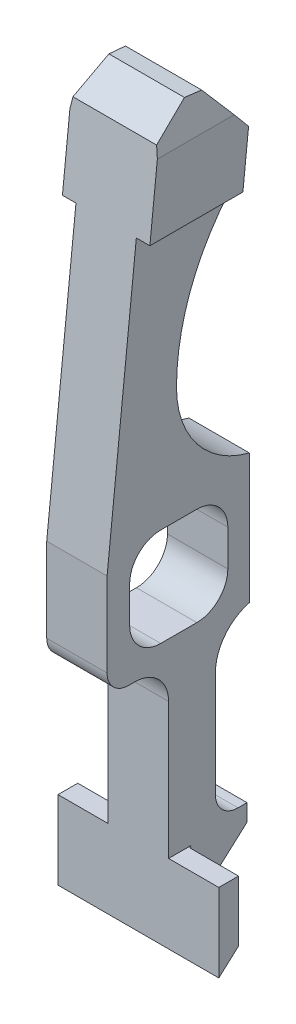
ISO-10303-21;
HEADER;
FILE_DESCRIPTION(('STEP AP214'),'2;1');
FILE_NAME('part.step','',(''),(''),'','','');
FILE_SCHEMA(('AUTOMOTIVE_DESIGN { 1 0 10303 214 1 1 1 1 }'));
ENDSEC;
DATA;
#1=APPLICATION_CONTEXT('core data for automotive mechanical design processes');
#2=APPLICATION_PROTOCOL_DEFINITION('international standard','automotive_design',2000,#1);
#3=PRODUCT_CONTEXT('',#1,'mechanical');
#4=PRODUCT('Part','Part','',(#3));
#5=PRODUCT_RELATED_PRODUCT_CATEGORY('part','',(#4));
#6=PRODUCT_DEFINITION_FORMATION('','',#4);
#7=PRODUCT_DEFINITION_CONTEXT('part definition',#1,'design');
#8=PRODUCT_DEFINITION('design','',#6,#7);
#9=PRODUCT_DEFINITION_SHAPE('','',#8);
#10=(LENGTH_UNIT() NAMED_UNIT(*) SI_UNIT(.MILLI.,.METRE.));
#11=(NAMED_UNIT(*) PLANE_ANGLE_UNIT() SI_UNIT($,.RADIAN.));
#12=(NAMED_UNIT(*) SI_UNIT($,.STERADIAN.) SOLID_ANGLE_UNIT());
#13=UNCERTAINTY_MEASURE_WITH_UNIT(LENGTH_MEASURE(1.E-05),#10,'distance_accuracy_value','');
#14=(GEOMETRIC_REPRESENTATION_CONTEXT(3) GLOBAL_UNCERTAINTY_ASSIGNED_CONTEXT((#13)) GLOBAL_UNIT_ASSIGNED_CONTEXT((#10,
#11,#12)) REPRESENTATION_CONTEXT('',''));
#15=CARTESIAN_POINT('',(0.,0.,0.));
#16=DIRECTION('',(0.,0.,1.));
#17=DIRECTION('',(1.,0.,0.));
#18=AXIS2_PLACEMENT_3D('',#15,#16,#17);
#19=CARTESIAN_POINT('',(1.3589,5.37249489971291,2.8321361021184));
#20=DIRECTION('',(0.,0.104528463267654,0.994521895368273));
#21=DIRECTION('',(0.,-0.994521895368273,0.104528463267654));
#22=AXIS2_PLACEMENT_3D('',#19,#20,#21);
#23=PLANE('',#22);
#24=DIRECTION('',(0.,0.994521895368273,-0.104528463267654));
#25=VECTOR('',#24,1.);
#26=CARTESIAN_POINT('',(1.9685,5.37249489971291,2.8321361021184));
#27=LINE('',#26,#25);
#28=CARTESIAN_POINT('',(1.9685,14.1478,1.90981437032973));
#29=VERTEX_POINT('',#28);
#30=CARTESIAN_POINT('',(1.9685,17.3588295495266,1.57232156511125));
#31=VERTEX_POINT('',#30);
#32=EDGE_CURVE('E337',#29,#31,#27,.T.);
#33=ORIENTED_EDGE('',*,*,#32,.T.);
#34=DIRECTION('',(-0.172725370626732,0.979574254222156,-0.102957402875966));
#35=VECTOR('',#34,1.);
#36=CARTESIAN_POINT('',(4.00077266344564,5.83323854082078,2.78370999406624));
#37=LINE('',#36,#35);
#38=CARTESIAN_POINT('',(1.88398253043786,17.8381519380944,1.52194275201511));
#39=VERTEX_POINT('',#38);
#40=EDGE_CURVE('E296',#31,#39,#37,.T.);
#41=ORIENTED_EDGE('',*,*,#40,.T.);
#42=DIRECTION('',(-1.,0.,0.));
#43=VECTOR('',#42,1.);
#44=CARTESIAN_POINT('',(1.9685,17.8381519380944,1.52194275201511));
#45=LINE('',#44,#43);
#46=CARTESIAN_POINT('',(-1.88398253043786,17.8381519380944,1.52194275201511));
#47=VERTEX_POINT('',#46);
#48=EDGE_CURVE('E318',#39,#47,#45,.T.);
#49=ORIENTED_EDGE('',*,*,#48,.T.);
#50=DIRECTION('',(0.172725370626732,0.979574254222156,-0.102957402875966));
#51=VECTOR('',#50,1.);
#52=CARTESIAN_POINT('',(-3.91968967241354,6.29308303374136,2.73537839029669));
#53=LINE('',#52,#51);
#54=CARTESIAN_POINT('',(-1.9685,17.3588295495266,1.57232156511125));
#55=VERTEX_POINT('',#54);
#56=EDGE_CURVE('E378',#55,#47,#53,.T.);
#57=ORIENTED_EDGE('',*,*,#56,.F.);
#58=DIRECTION('',(0.,0.994521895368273,-0.104528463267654));
#59=VECTOR('',#58,1.);
#60=CARTESIAN_POINT('',(-1.9685,5.37249489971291,2.8321361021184));
#61=LINE('',#60,#59);
#62=CARTESIAN_POINT('',(-1.9685,14.1478,1.90981437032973));
#63=VERTEX_POINT('',#62);
#64=EDGE_CURVE('E326',#63,#55,#61,.T.);
#65=ORIENTED_EDGE('',*,*,#64,.F.);
#66=DIRECTION('',(-1.,0.,0.));
#67=VECTOR('',#66,1.);
#68=CARTESIAN_POINT('',(1.9685,14.1478,1.90981437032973));
#69=LINE('',#68,#67);
#70=CARTESIAN_POINT('',(-1.3589,14.1478,1.90981437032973));
#71=VERTEX_POINT('',#70);
#72=EDGE_CURVE('E353',#71,#63,#69,.T.);
#73=ORIENTED_EDGE('',*,*,#72,.F.);
#74=DIRECTION('',(0.,0.994521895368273,-0.104528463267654));
#75=VECTOR('',#74,1.);
#76=CARTESIAN_POINT('',(-1.3589,5.37249489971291,2.8321361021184));
#77=LINE('',#76,#75);
#78=CARTESIAN_POINT('',(-1.3589,1.62703310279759,3.22579999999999));
#79=VERTEX_POINT('',#78);
#80=EDGE_CURVE('E536',#79,#71,#77,.T.);
#81=ORIENTED_EDGE('',*,*,#80,.F.);
#82=DIRECTION('',(-1.,0.,0.));
#83=VECTOR('',#82,1.);
#84=CARTESIAN_POINT('',(1.3589,1.62703310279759,3.22579999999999));
#85=LINE('',#84,#83);
#86=CARTESIAN_POINT('',(1.3589,1.62703310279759,3.22579999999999));
#87=VERTEX_POINT('',#86);
#88=EDGE_CURVE('E677',#87,#79,#85,.T.);
#89=ORIENTED_EDGE('',*,*,#88,.F.);
#90=DIRECTION('',(0.,0.994521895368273,-0.104528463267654));
#91=VECTOR('',#90,1.);
#92=CARTESIAN_POINT('',(1.3589,5.37249489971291,2.8321361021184));
#93=LINE('',#92,#91);
#94=CARTESIAN_POINT('',(1.3589,14.1478,1.90981437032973));
#95=VERTEX_POINT('',#94);
#96=EDGE_CURVE('E477',#87,#95,#93,.T.);
#97=ORIENTED_EDGE('',*,*,#96,.T.);
#98=EDGE_CURVE('E357',#29,#95,#69,.T.);
#99=ORIENTED_EDGE('',*,*,#98,.F.);
#100=EDGE_LOOP('',(#33,#41,#49,#57,#65,#73,#81,#89,#97,#99));
#101=FACE_BOUND('',#100,.T.);
#102=ADVANCED_FACE('F30',(#101),#23,.T.);
#103=CARTESIAN_POINT('',(1.9685,-4.45635367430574,-20.1908234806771));
#104=DIRECTION('',(0.,0.642787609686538,-0.766044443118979));
#105=DIRECTION('',(0.,0.766044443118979,0.642787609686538));
#106=AXIS2_PLACEMENT_3D('',#103,#104,#105);
#107=PLANE('',#106);
#108=DIRECTION('',(-1.,0.,0.));
#109=VECTOR('',#108,1.);
#110=CARTESIAN_POINT('',(1.9685,18.8031788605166,-0.673758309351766));
#111=LINE('',#110,#109);
#112=CARTESIAN_POINT('',(1.71382224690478,18.8031788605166,-0.673758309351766));
#113=VERTEX_POINT('',#112);
#114=CARTESIAN_POINT('',(-1.71382224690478,18.8031788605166,-0.673758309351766));
#115=VERTEX_POINT('',#114);
#116=EDGE_CURVE('E311',#113,#115,#111,.T.);
#117=ORIENTED_EDGE('',*,*,#116,.F.);
#118=DIRECTION('',(0.133858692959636,-0.759150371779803,-0.637002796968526));
#119=VECTOR('',#118,1.);
#120=CARTESIAN_POINT('',(5.74618134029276,-4.06546595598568,-19.862829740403));
#121=LINE('',#120,#119);
#122=CARTESIAN_POINT('',(1.9685,17.3588295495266,-1.88571128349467));
#123=VERTEX_POINT('',#122);
#124=EDGE_CURVE('E293',#113,#123,#121,.T.);
#125=ORIENTED_EDGE('',*,*,#124,.T.);
#126=DIRECTION('',(0.,-0.766044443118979,-0.642787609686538));
#127=VECTOR('',#126,1.);
#128=CARTESIAN_POINT('',(1.9685,-4.45635367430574,-20.1908234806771));
#129=LINE('',#128,#127);
#130=CARTESIAN_POINT('',(1.9685,16.5851487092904,-2.53490659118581));
#131=VERTEX_POINT('',#130);
#132=EDGE_CURVE('E308',#123,#131,#129,.T.);
#133=ORIENTED_EDGE('',*,*,#132,.T.);
#134=DIRECTION('',(-1.,0.,0.));
#135=VECTOR('',#134,1.);
#136=CARTESIAN_POINT('',(1.9685,16.5851487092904,-2.53490659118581));
#137=LINE('',#136,#135);
#138=CARTESIAN_POINT('',(-1.9685,16.5851487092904,-2.53490659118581));
#139=VERTEX_POINT('',#138);
#140=EDGE_CURVE('E341',#131,#139,#137,.T.);
#141=ORIENTED_EDGE('',*,*,#140,.T.);
#142=DIRECTION('',(0.,-0.766044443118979,-0.642787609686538));
#143=VECTOR('',#142,1.);
#144=CARTESIAN_POINT('',(-1.9685,-4.45635367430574,-20.1908234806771));
#145=LINE('',#144,#143);
#146=CARTESIAN_POINT('',(-1.9685,17.3588295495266,-1.88571128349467));
#147=VERTEX_POINT('',#146);
#148=EDGE_CURVE('E336',#147,#139,#145,.T.);
#149=ORIENTED_EDGE('',*,*,#148,.F.);
#150=DIRECTION('',(-0.133858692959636,-0.759150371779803,-0.637002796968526));
#151=VECTOR('',#150,1.);
#152=CARTESIAN_POINT('',(-5.67563758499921,-3.66539243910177,-19.5271281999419));
#153=LINE('',#152,#151);
#154=EDGE_CURVE('E375',#115,#147,#153,.T.);
#155=ORIENTED_EDGE('',*,*,#154,.F.);
#156=EDGE_LOOP('',(#117,#125,#133,#141,#149,#155));
#157=FACE_BOUND('',#156,.T.);
#158=ADVANCED_FACE('F306',(#157),#107,.T.);
#159=CARTESIAN_POINT('',(1.9685,15.7763416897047,-29.4721902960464));
#160=DIRECTION('',(0.,-0.994521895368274,0.104528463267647));
#161=DIRECTION('',(0.,-0.104528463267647,-0.994521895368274));
#162=AXIS2_PLACEMENT_3D('',#159,#160,#161);
#163=PLANE('',#162);
#164=DIRECTION('',(-0.0184280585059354,0.104510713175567,0.99435301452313));
#165=VECTOR('',#164,1.);
#166=CARTESIAN_POINT('',(2.24744054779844,15.776879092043,-29.4670772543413));
#167=LINE('',#166,#165);
#168=CARTESIAN_POINT('',(1.69977768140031,18.8828295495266,0.0840673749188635));
#169=VERTEX_POINT('',#168);
#170=EDGE_CURVE('E312',#113,#169,#167,.T.);
#171=ORIENTED_EDGE('',*,*,#170,.F.);
#172=ORIENTED_EDGE('',*,*,#116,.T.);
#173=DIRECTION('',(0.0184280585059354,0.104510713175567,0.99435301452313));
#174=VECTOR('',#173,1.);
#175=CARTESIAN_POINT('',(-2.24610356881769,15.7844614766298,-29.3949356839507));
#176=LINE('',#175,#174);
#177=CARTESIAN_POINT('',(-1.69977768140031,18.8828295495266,0.0840673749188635));
#178=VERTEX_POINT('',#177);
#179=EDGE_CURVE('E379',#115,#178,#176,.T.);
#180=ORIENTED_EDGE('',*,*,#179,.T.);
#181=DIRECTION('',(-1.,0.,0.));
#182=VECTOR('',#181,1.);
#183=CARTESIAN_POINT('',(1.9685,18.8828295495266,0.0840673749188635));
#184=LINE('',#183,#182);
#185=EDGE_CURVE('E320',#169,#178,#184,.T.);
#186=ORIENTED_EDGE('',*,*,#185,.F.);
#187=EDGE_LOOP('',(#171,#172,#180,#186));
#188=FACE_BOUND('',#187,.T.);
#189=ADVANCED_FACE('F739',(#188),#163,.F.);
#190=CARTESIAN_POINT('',(1.9685,26.4668480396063,-10.3544385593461));
#191=DIRECTION('',(0.,-0.809016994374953,-0.587785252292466));
#192=DIRECTION('',(0.,0.587785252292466,-0.809016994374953));
#193=AXIS2_PLACEMENT_3D('',#190,#191,#192);
#194=PLANE('',#193);
#195=DIRECTION('',(0.103090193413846,-0.58465353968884,0.80470656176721));
#196=VECTOR('',#195,1.);
#197=CARTESIAN_POINT('',(0.379578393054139,26.3700517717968,-10.221209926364));
#198=LINE('',#197,#196);
#199=EDGE_CURVE('E701',#169,#39,#198,.T.);
#200=ORIENTED_EDGE('',*,*,#199,.F.);
#201=ORIENTED_EDGE('',*,*,#185,.T.);
#202=DIRECTION('',(-0.103090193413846,-0.58465353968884,0.80470656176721));
#203=VECTOR('',#202,1.);
#204=CARTESIAN_POINT('',(-0.337737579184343,26.6073428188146,-10.547813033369));
#205=LINE('',#204,#203);
#206=EDGE_CURVE('E385',#178,#47,#205,.T.);
#207=ORIENTED_EDGE('',*,*,#206,.T.);
#208=ORIENTED_EDGE('',*,*,#48,.F.);
#209=EDGE_LOOP('',(#200,#201,#207,#208));
#210=FACE_BOUND('',#209,.T.);
#211=ADVANCED_FACE('F696',(#210),#194,.F.);
#212=CARTESIAN_POINT('',(1.9685,2.12794584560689,-28.0376860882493));
#213=DIRECTION('',(1.,0.,0.));
#214=DIRECTION('',(0.,0.,-1.));
#215=AXIS2_PLACEMENT_3D('',#212,#213,#214);
#216=PLANE('',#215);
#217=ORIENTED_EDGE('',*,*,#132,.F.);
#218=DIRECTION('',(0.,0.,1.));
#219=VECTOR('',#218,1.);
#220=CARTESIAN_POINT('',(1.9685,17.3588295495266,-28.0376860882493));
#221=LINE('',#220,#219);
#222=EDGE_CURVE('E290',#123,#31,#221,.T.);
#223=ORIENTED_EDGE('',*,*,#222,.T.);
#224=ORIENTED_EDGE('',*,*,#32,.F.);
#225=DIRECTION('',(0.,0.,-1.));
#226=VECTOR('',#225,1.);
#227=CARTESIAN_POINT('',(1.9685,14.1478,-28.0376860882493));
#228=LINE('',#227,#226);
#229=CARTESIAN_POINT('',(1.9685,14.1478,-2.27873091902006));
#230=VERTEX_POINT('',#229);
#231=EDGE_CURVE('E322',#29,#230,#228,.T.);
#232=ORIENTED_EDGE('',*,*,#231,.T.);
#233=DIRECTION('',(0.,-0.994521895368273,0.104528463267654));
#234=VECTOR('',#233,1.);
#235=CARTESIAN_POINT('',(1.9685,4.93707113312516,-1.31064430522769));
#236=LINE('',#235,#234);
#237=EDGE_CURVE('E317',#131,#230,#236,.T.);
#238=ORIENTED_EDGE('',*,*,#237,.F.);
#239=EDGE_LOOP('',(#217,#223,#224,#232,#238));
#240=FACE_BOUND('',#239,.T.);
#241=ADVANCED_FACE('F315',(#240),#216,.T.);
#242=CARTESIAN_POINT('',(1.3589,2.12794584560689,-28.0376860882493));
#243=DIRECTION('',(1.,0.,0.));
#244=DIRECTION('',(0.,0.,-1.));
#245=AXIS2_PLACEMENT_3D('',#242,#243,#244);
#246=PLANE('',#245);
#247=CARTESIAN_POINT('',(1.3589,0.812800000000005,0.812799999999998));
#248=DIRECTION('',(1.,0.,0.));
#249=DIRECTION('',(0.,0.,-1.));
#250=AXIS2_PLACEMENT_3D('',#247,#248,#249);
#251=CIRCLE('',#250,1.397);
#252=CARTESIAN_POINT('',(1.3589,2.2098,0.812799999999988));
#253=VERTEX_POINT('',#252);
#254=CARTESIAN_POINT('',(1.3589,0.812799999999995,2.2098));
#255=VERTEX_POINT('',#254);
#256=EDGE_CURVE('E429',#253,#255,#251,.T.);
#257=ORIENTED_EDGE('',*,*,#256,.F.);
#258=DIRECTION('',(0.,0.,1.));
#259=VECTOR('',#258,1.);
#260=CARTESIAN_POINT('',(1.3589,2.2098,0.812799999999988));
#261=LINE('',#260,#259);
#262=CARTESIAN_POINT('',(1.3589,2.2098,-0.812799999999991));
#263=VERTEX_POINT('',#262);
#264=EDGE_CURVE('E449',#263,#253,#261,.T.);
#265=ORIENTED_EDGE('',*,*,#264,.F.);
#266=CARTESIAN_POINT('',(1.3589,0.812800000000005,-0.812800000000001));
#267=DIRECTION('',(1.,0.,0.));
#268=DIRECTION('',(0.,0.,-1.));
#269=AXIS2_PLACEMENT_3D('',#266,#267,#268);
#270=CIRCLE('',#269,1.397);
#271=CARTESIAN_POINT('',(1.3589,0.812799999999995,-2.2098));
#272=VERTEX_POINT('',#271);
#273=EDGE_CURVE('E446',#272,#263,#270,.T.);
#274=ORIENTED_EDGE('',*,*,#273,.F.);
#275=DIRECTION('',(0.,1.,0.));
#276=VECTOR('',#275,1.);
#277=CARTESIAN_POINT('',(1.3589,-0.812799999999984,-2.2098));
#278=LINE('',#277,#276);
#279=CARTESIAN_POINT('',(1.3589,-0.812799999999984,-2.2098));
#280=VERTEX_POINT('',#279);
#281=EDGE_CURVE('E443',#280,#272,#278,.T.);
#282=ORIENTED_EDGE('',*,*,#281,.F.);
#283=CARTESIAN_POINT('',(1.3589,-0.812799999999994,-0.812800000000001));
#284=DIRECTION('',(1.,0.,0.));
#285=DIRECTION('',(0.,0.,-1.));
#286=AXIS2_PLACEMENT_3D('',#283,#284,#285);
#287=CIRCLE('',#286,1.397);
#288=CARTESIAN_POINT('',(1.3589,-2.20979999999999,-0.812799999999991));
#289=VERTEX_POINT('',#288);
#290=EDGE_CURVE('E440',#289,#280,#287,.T.);
#291=ORIENTED_EDGE('',*,*,#290,.F.);
#292=DIRECTION('',(0.,0.,-1.));
#293=VECTOR('',#292,1.);
#294=CARTESIAN_POINT('',(1.3589,-2.20979999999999,0.812799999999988));
#295=LINE('',#294,#293);
#296=CARTESIAN_POINT('',(1.3589,-2.20979999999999,0.812799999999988));
#297=VERTEX_POINT('',#296);
#298=EDGE_CURVE('E437',#297,#289,#295,.T.);
#299=ORIENTED_EDGE('',*,*,#298,.F.);
#300=CARTESIAN_POINT('',(1.3589,-0.812799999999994,0.812799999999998));
#301=DIRECTION('',(1.,0.,0.));
#302=DIRECTION('',(0.,0.,-1.));
#303=AXIS2_PLACEMENT_3D('',#300,#301,#302);
#304=CIRCLE('',#303,1.397);
#305=CARTESIAN_POINT('',(1.3589,-0.812799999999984,2.2098));
#306=VERTEX_POINT('',#305);
#307=EDGE_CURVE('E434',#306,#297,#304,.T.);
#308=ORIENTED_EDGE('',*,*,#307,.F.);
#309=DIRECTION('',(0.,-1.,0.));
#310=VECTOR('',#309,1.);
#311=CARTESIAN_POINT('',(1.3589,-0.812799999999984,2.2098));
#312=LINE('',#311,#310);
#313=EDGE_CURVE('E431',#255,#306,#312,.T.);
#314=ORIENTED_EDGE('',*,*,#313,.F.);
#315=EDGE_LOOP('',(#257,#265,#274,#282,#291,#299,#308,#314));
#316=FACE_BOUND('',#315,.T.);
#317=DIRECTION('',(0.,0.,1.));
#318=VECTOR('',#317,1.);
#319=CARTESIAN_POINT('',(1.3589,-10.7696,0.457199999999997));
#320=LINE('',#319,#318);
#321=CARTESIAN_POINT('',(1.3589,-10.7696,-0.558800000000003));
#322=VERTEX_POINT('',#321);
#323=CARTESIAN_POINT('',(1.3589,-10.7696,0.457199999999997));
#324=VERTEX_POINT('',#323);
#325=EDGE_CURVE('E409',#322,#324,#320,.T.);
#326=ORIENTED_EDGE('',*,*,#325,.F.);
#327=DIRECTION('',(0.,1.,0.));
#328=VECTOR('',#327,1.);
#329=CARTESIAN_POINT('',(1.3589,2.12794584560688,-0.558800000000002));
#330=LINE('',#329,#328);
#331=CARTESIAN_POINT('',(1.3589,-13.3853894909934,-0.558800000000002));
#332=VERTEX_POINT('',#331);
#333=EDGE_CURVE('E571',#322,#332,#330,.F.);
#334=ORIENTED_EDGE('',*,*,#333,.T.);
#335=DIRECTION('',(0.,0.669130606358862,-0.743144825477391));
#336=VECTOR('',#335,1.);
#337=CARTESIAN_POINT('',(1.3589,7.22466256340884,-23.4485817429));
#338=LINE('',#337,#336);
#339=CARTESIAN_POINT('',(1.3589,-11.121233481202,-3.0734));
#340=VERTEX_POINT('',#339);
#341=EDGE_CURVE('E503',#332,#340,#338,.T.);
#342=ORIENTED_EDGE('',*,*,#341,.T.);
#343=DIRECTION('',(0.,1.,0.));
#344=VECTOR('',#343,1.);
#345=CARTESIAN_POINT('',(1.3589,2.12794584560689,-3.0734));
#346=LINE('',#345,#344);
#347=CARTESIAN_POINT('',(1.3589,-10.359233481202,-3.0734));
#348=VERTEX_POINT('',#347);
#349=EDGE_CURVE('E505',#340,#348,#346,.T.);
#350=ORIENTED_EDGE('',*,*,#349,.T.);
#351=DIRECTION('',(0.,0.,1.));
#352=VECTOR('',#351,1.);
#353=CARTESIAN_POINT('',(1.3589,-10.359233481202,-28.0376860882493));
#354=LINE('',#353,#352);
#355=CARTESIAN_POINT('',(1.3589,-10.359233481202,-2.667));
#356=VERTEX_POINT('',#355);
#357=EDGE_CURVE('E507',#348,#356,#354,.T.);
#358=ORIENTED_EDGE('',*,*,#357,.T.);
#359=CARTESIAN_POINT('',(1.3589,-9.34323348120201,-2.667));
#360=DIRECTION('',(1.,0.,0.));
#361=DIRECTION('',(0.,0.,-1.));
#362=AXIS2_PLACEMENT_3D('',#359,#360,#361);
#363=CIRCLE('',#362,1.016);
#364=CARTESIAN_POINT('',(1.3589,-9.34323348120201,-1.651));
#365=VERTEX_POINT('',#364);
#366=EDGE_CURVE('E509',#365,#356,#363,.T.);
#367=ORIENTED_EDGE('',*,*,#366,.F.);
#368=DIRECTION('',(0.,-1.,0.));
#369=VECTOR('',#368,1.);
#370=CARTESIAN_POINT('',(1.3589,2.12794584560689,-1.651));
#371=LINE('',#370,#369);
#372=CARTESIAN_POINT('',(1.3589,-4.58367553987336,-1.651));
#373=VERTEX_POINT('',#372);
#374=EDGE_CURVE('E512',#373,#365,#371,.T.);
#375=ORIENTED_EDGE('',*,*,#374,.F.);
#376=CARTESIAN_POINT('',(1.3589,-4.58367553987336,-3.683));
#377=DIRECTION('',(1.,0.,0.));
#378=DIRECTION('',(0.,0.,-1.));
#379=AXIS2_PLACEMENT_3D('',#376,#377,#378);
#380=CIRCLE('',#379,2.032);
#381=CARTESIAN_POINT('',(1.3589,-2.6162,-3.175));
#382=VERTEX_POINT('',#381);
#383=EDGE_CURVE('E515',#382,#373,#380,.T.);
#384=ORIENTED_EDGE('',*,*,#383,.F.);
#385=DIRECTION('',(0.,-1.,0.));
#386=VECTOR('',#385,1.);
#387=CARTESIAN_POINT('',(1.3589,2.12794584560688,-3.175));
#388=LINE('',#387,#386);
#389=CARTESIAN_POINT('',(1.3589,3.22626184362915,-3.175));
#390=VERTEX_POINT('',#389);
#391=EDGE_CURVE('E518',#390,#382,#388,.T.);
#392=ORIENTED_EDGE('',*,*,#391,.F.);
#393=CARTESIAN_POINT('',(1.3589,7.4168,-4.2164));
#394=DIRECTION('',(1.,0.,0.));
#395=DIRECTION('',(0.,0.,-1.));
#396=AXIS2_PLACEMENT_3D('',#393,#394,#395);
#397=CIRCLE('',#396,4.318);
#398=CARTESIAN_POINT('',(1.3589,7.41680000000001,0.1016));
#399=VERTEX_POINT('',#398);
#400=EDGE_CURVE('E521',#399,#390,#397,.T.);
#401=ORIENTED_EDGE('',*,*,#400,.F.);
#402=CARTESIAN_POINT('',(1.3589,7.4168,-9.8044));
#403=DIRECTION('',(1.,0.,0.));
#404=DIRECTION('',(0.,0.,-1.));
#405=AXIS2_PLACEMENT_3D('',#402,#403,#404);
#406=CIRCLE('',#405,9.906);
#407=CARTESIAN_POINT('',(1.3589,13.8175404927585,-2.24401924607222));
#408=VERTEX_POINT('',#407);
#409=EDGE_CURVE('E482',#408,#399,#406,.T.);
#410=ORIENTED_EDGE('',*,*,#409,.F.);
#411=DIRECTION('',(0.,-0.994521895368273,0.104528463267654));
#412=VECTOR('',#411,1.);
#413=CARTESIAN_POINT('',(1.3589,4.93707113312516,-1.31064430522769));
#414=LINE('',#413,#412);
#415=CARTESIAN_POINT('',(1.3589,14.1478,-2.27873091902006));
#416=VERTEX_POINT('',#415);
#417=EDGE_CURVE('E478',#416,#408,#414,.T.);
#418=ORIENTED_EDGE('',*,*,#417,.F.);
#419=DIRECTION('',(0.,0.,-1.));
#420=VECTOR('',#419,1.);
#421=CARTESIAN_POINT('',(1.3589,14.1478,-28.0376860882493));
#422=LINE('',#421,#420);
#423=EDGE_CURVE('E473',#95,#416,#422,.T.);
#424=ORIENTED_EDGE('',*,*,#423,.F.);
#425=ORIENTED_EDGE('',*,*,#96,.F.);
#426=DIRECTION('',(0.,-1.,0.));
#427=VECTOR('',#426,1.);
#428=CARTESIAN_POINT('',(1.3589,2.12794584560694,3.22579999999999));
#429=LINE('',#428,#427);
#430=CARTESIAN_POINT('',(1.3589,-2.15839002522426,3.2258));
#431=VERTEX_POINT('',#430);
#432=EDGE_CURVE('E480',#87,#431,#429,.T.);
#433=ORIENTED_EDGE('',*,*,#432,.T.);
#434=CARTESIAN_POINT('',(1.3589,-2.15839002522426,2.25999002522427));
#435=DIRECTION('',(1.,0.,0.));
#436=DIRECTION('',(0.,0.,-1.));
#437=AXIS2_PLACEMENT_3D('',#434,#435,#436);
#438=CIRCLE('',#437,0.965809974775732);
#439=CARTESIAN_POINT('',(1.3589,-3.12419999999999,2.25999002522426));
#440=VERTEX_POINT('',#439);
#441=EDGE_CURVE('E493',#431,#440,#438,.T.);
#442=ORIENTED_EDGE('',*,*,#441,.T.);
#443=DIRECTION('',(0.,0.,-1.));
#444=VECTOR('',#443,1.);
#445=CARTESIAN_POINT('',(1.3589,-3.12419999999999,-28.0376860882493));
#446=LINE('',#445,#444);
#447=CARTESIAN_POINT('',(1.3589,-3.12419999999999,1.9812));
#448=VERTEX_POINT('',#447);
#449=EDGE_CURVE('E495',#440,#448,#446,.T.);
#450=ORIENTED_EDGE('',*,*,#449,.T.);
#451=CARTESIAN_POINT('',(1.3589,-4.64819999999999,1.9812));
#452=DIRECTION('',(1.,0.,0.));
#453=DIRECTION('',(0.,0.,-1.));
#454=AXIS2_PLACEMENT_3D('',#451,#452,#453);
#455=CIRCLE('',#454,1.524);
#456=CARTESIAN_POINT('',(1.3589,-4.64819999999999,0.457199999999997));
#457=VERTEX_POINT('',#456);
#458=EDGE_CURVE('E497',#457,#448,#455,.T.);
#459=ORIENTED_EDGE('',*,*,#458,.F.);
#460=DIRECTION('',(0.,-1.,0.));
#461=VECTOR('',#460,1.);
#462=CARTESIAN_POINT('',(1.3589,2.12794584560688,0.457199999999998));
#463=LINE('',#462,#461);
#464=EDGE_CURVE('E500',#457,#324,#463,.T.);
#465=ORIENTED_EDGE('',*,*,#464,.T.);
#466=EDGE_LOOP('',(#326,#334,#342,#350,#358,#367,#375,#384,#392,#401,#410,#418,#424,#425,#433,
#442,#450,#459,#465));
#467=FACE_BOUND('',#466,.T.);
#468=ADVANCED_FACE('F702',(#316,#467),#246,.T.);
#469=CARTESIAN_POINT('',(1.3589,7.4168,-9.8044));
#470=DIRECTION('',(-1.,0.,0.));
#471=DIRECTION('',(0.,0.,1.));
#472=AXIS2_PLACEMENT_3D('',#469,#470,#471);
#473=CYLINDRICAL_SURFACE('',#472,9.906);
#474=CARTESIAN_POINT('',(-1.3589,7.4168,-9.8044));
#475=DIRECTION('',(1.,0.,0.));
#476=DIRECTION('',(0.,0.,-1.));
#477=AXIS2_PLACEMENT_3D('',#474,#475,#476);
#478=CIRCLE('',#477,9.906);
#479=CARTESIAN_POINT('',(-1.3589,13.8175404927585,-2.24401924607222));
#480=VERTEX_POINT('',#479);
#481=CARTESIAN_POINT('',(-1.3589,7.41680000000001,0.1016));
#482=VERTEX_POINT('',#481);
#483=EDGE_CURVE('E525',#480,#482,#478,.T.);
#484=ORIENTED_EDGE('',*,*,#483,.F.);
#485=DIRECTION('',(-1.,0.,0.));
#486=VECTOR('',#485,1.);
#487=CARTESIAN_POINT('',(1.3589,13.8175404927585,-2.24401924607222));
#488=LINE('',#487,#486);
#489=EDGE_CURVE('E486',#408,#480,#488,.T.);
#490=ORIENTED_EDGE('',*,*,#489,.F.);
#491=ORIENTED_EDGE('',*,*,#409,.T.);
#492=DIRECTION('',(-1.,0.,0.));
#493=VECTOR('',#492,1.);
#494=CARTESIAN_POINT('',(1.3589,7.41680000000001,0.1016));
#495=LINE('',#494,#493);
#496=EDGE_CURVE('E524',#399,#482,#495,.T.);
#497=ORIENTED_EDGE('',*,*,#496,.T.);
#498=EDGE_LOOP('',(#484,#490,#491,#497));
#499=FACE_BOUND('',#498,.T.);
#500=ADVANCED_FACE('F685',(#499),#473,.F.);
#501=CARTESIAN_POINT('',(1.3589,4.93707113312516,-1.31064430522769));
#502=DIRECTION('',(0.,-0.104528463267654,-0.994521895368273));
#503=DIRECTION('',(0.,0.994521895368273,-0.104528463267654));
#504=AXIS2_PLACEMENT_3D('',#501,#502,#503);
#505=PLANE('',#504);
#506=DIRECTION('',(0.,-0.994521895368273,0.104528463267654));
#507=VECTOR('',#506,1.);
#508=CARTESIAN_POINT('',(-1.3589,4.93707113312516,-1.31064430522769));
#509=LINE('',#508,#507);
#510=CARTESIAN_POINT('',(-1.3589,14.1478,-2.27873091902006));
#511=VERTEX_POINT('',#510);
#512=EDGE_CURVE('E363',#511,#480,#509,.T.);
#513=ORIENTED_EDGE('',*,*,#512,.F.);
#514=DIRECTION('',(-1.,0.,0.));
#515=VECTOR('',#514,1.);
#516=CARTESIAN_POINT('',(1.9685,14.1478,-2.27873091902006));
#517=LINE('',#516,#515);
#518=CARTESIAN_POINT('',(-1.9685,14.1478,-2.27873091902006));
#519=VERTEX_POINT('',#518);
#520=EDGE_CURVE('E343',#511,#519,#517,.T.);
#521=ORIENTED_EDGE('',*,*,#520,.T.);
#522=DIRECTION('',(0.,-0.994521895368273,0.104528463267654));
#523=VECTOR('',#522,1.);
#524=CARTESIAN_POINT('',(-1.9685,4.93707113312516,-1.31064430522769));
#525=LINE('',#524,#523);
#526=EDGE_CURVE('E333',#139,#519,#525,.T.);
#527=ORIENTED_EDGE('',*,*,#526,.F.);
#528=ORIENTED_EDGE('',*,*,#140,.F.);
#529=ORIENTED_EDGE('',*,*,#237,.T.);
#530=EDGE_CURVE('E351',#230,#416,#517,.T.);
#531=ORIENTED_EDGE('',*,*,#530,.T.);
#532=ORIENTED_EDGE('',*,*,#417,.T.);
#533=ORIENTED_EDGE('',*,*,#489,.T.);
#534=EDGE_LOOP('',(#513,#521,#527,#528,#529,#531,#532,#533));
#535=FACE_BOUND('',#534,.T.);
#536=ADVANCED_FACE('F361',(#535),#505,.T.);
#537=CARTESIAN_POINT('',(1.3589,2.12794584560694,3.22579999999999));
#538=DIRECTION('',(0.,0.,-1.));
#539=DIRECTION('',(0.,1.,0.));
#540=AXIS2_PLACEMENT_3D('',#537,#538,#539);
#541=PLANE('',#540);
#542=DIRECTION('',(0.,-1.,0.));
#543=VECTOR('',#542,1.);
#544=CARTESIAN_POINT('',(-1.3589,2.12794584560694,3.22579999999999));
#545=LINE('',#544,#543);
#546=CARTESIAN_POINT('',(-1.3589,-2.15839002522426,3.2258));
#547=VERTEX_POINT('',#546);
#548=EDGE_CURVE('E530',#79,#547,#545,.T.);
#549=ORIENTED_EDGE('',*,*,#548,.T.);
#550=DIRECTION('',(-1.,0.,0.));
#551=VECTOR('',#550,1.);
#552=CARTESIAN_POINT('',(1.3589,-2.15839002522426,3.2258));
#553=LINE('',#552,#551);
#554=EDGE_CURVE('E675',#431,#547,#553,.T.);
#555=ORIENTED_EDGE('',*,*,#554,.F.);
#556=ORIENTED_EDGE('',*,*,#432,.F.);
#557=ORIENTED_EDGE('',*,*,#88,.T.);
#558=EDGE_LOOP('',(#549,#555,#556,#557));
#559=FACE_BOUND('',#558,.T.);
#560=ADVANCED_FACE('F706',(#559),#541,.F.);
#561=CARTESIAN_POINT('',(1.3589,-2.15839002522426,2.25999002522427));
#562=DIRECTION('',(-1.,0.,0.));
#563=DIRECTION('',(0.,0.,1.));
#564=AXIS2_PLACEMENT_3D('',#561,#562,#563);
#565=CYLINDRICAL_SURFACE('',#564,0.965809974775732);
#566=CARTESIAN_POINT('',(-1.3589,-2.15839002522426,2.25999002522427));
#567=DIRECTION('',(1.,0.,0.));
#568=DIRECTION('',(0.,0.,-1.));
#569=AXIS2_PLACEMENT_3D('',#566,#567,#568);
#570=CIRCLE('',#569,0.965809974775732);
#571=CARTESIAN_POINT('',(-1.3589,-3.12419999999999,2.25999002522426));
#572=VERTEX_POINT('',#571);
#573=EDGE_CURVE('E711',#547,#572,#570,.T.);
#574=ORIENTED_EDGE('',*,*,#573,.T.);
#575=DIRECTION('',(-1.,0.,0.));
#576=VECTOR('',#575,1.);
#577=CARTESIAN_POINT('',(1.3589,-3.12419999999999,2.25999002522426));
#578=LINE('',#577,#576);
#579=EDGE_CURVE('E672',#440,#572,#578,.T.);
#580=ORIENTED_EDGE('',*,*,#579,.F.);
#581=ORIENTED_EDGE('',*,*,#441,.F.);
#582=ORIENTED_EDGE('',*,*,#554,.T.);
#583=EDGE_LOOP('',(#574,#580,#581,#582));
#584=FACE_BOUND('',#583,.T.);
#585=ADVANCED_FACE('F709',(#584),#565,.T.);
#586=CARTESIAN_POINT('',(1.3589,-3.12419999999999,-28.0376860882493));
#587=DIRECTION('',(0.,1.,0.));
#588=DIRECTION('',(0.,0.,1.));
#589=AXIS2_PLACEMENT_3D('',#586,#587,#588);
#590=PLANE('',#589);
#591=DIRECTION('',(0.,0.,-1.));
#592=VECTOR('',#591,1.);
#593=CARTESIAN_POINT('',(-1.3589,-3.12419999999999,-28.0376860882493));
#594=LINE('',#593,#592);
#595=CARTESIAN_POINT('',(-1.3589,-3.12419999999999,1.9812));
#596=VERTEX_POINT('',#595);
#597=EDGE_CURVE('E723',#572,#596,#594,.T.);
#598=ORIENTED_EDGE('',*,*,#597,.T.);
#599=DIRECTION('',(-1.,0.,0.));
#600=VECTOR('',#599,1.);
#601=CARTESIAN_POINT('',(1.3589,-3.12419999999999,1.9812));
#602=LINE('',#601,#600);
#603=EDGE_CURVE('E670',#448,#596,#602,.T.);
#604=ORIENTED_EDGE('',*,*,#603,.F.);
#605=ORIENTED_EDGE('',*,*,#449,.F.);
#606=ORIENTED_EDGE('',*,*,#579,.T.);
#607=EDGE_LOOP('',(#598,#604,#605,#606));
#608=FACE_BOUND('',#607,.T.);
#609=ADVANCED_FACE('F716',(#608),#590,.F.);
#610=CARTESIAN_POINT('',(1.3589,-4.64819999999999,1.9812));
#611=DIRECTION('',(-1.,0.,0.));
#612=DIRECTION('',(0.,0.,1.));
#613=AXIS2_PLACEMENT_3D('',#610,#611,#612);
#614=CYLINDRICAL_SURFACE('',#613,1.524);
#615=CARTESIAN_POINT('',(-1.3589,-4.64819999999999,1.9812));
#616=DIRECTION('',(1.,0.,0.));
#617=DIRECTION('',(0.,0.,-1.));
#618=AXIS2_PLACEMENT_3D('',#615,#616,#617);
#619=CIRCLE('',#618,1.524);
#620=CARTESIAN_POINT('',(-1.3589,-4.64819999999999,0.457199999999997));
#621=VERTEX_POINT('',#620);
#622=EDGE_CURVE('E633',#621,#596,#619,.T.);
#623=ORIENTED_EDGE('',*,*,#622,.F.);
#624=DIRECTION('',(-1.,0.,0.));
#625=VECTOR('',#624,1.);
#626=CARTESIAN_POINT('',(1.3589,-4.64819999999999,0.457199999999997));
#627=LINE('',#626,#625);
#628=EDGE_CURVE('E606',#457,#621,#627,.T.);
#629=ORIENTED_EDGE('',*,*,#628,.F.);
#630=ORIENTED_EDGE('',*,*,#458,.T.);
#631=ORIENTED_EDGE('',*,*,#603,.T.);
#632=EDGE_LOOP('',(#623,#629,#630,#631));
#633=FACE_BOUND('',#632,.T.);
#634=ADVANCED_FACE('F721',(#633),#614,.F.);
#635=CARTESIAN_POINT('',(1.3589,2.12794584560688,0.457199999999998));
#636=DIRECTION('',(0.,0.,-1.));
#637=DIRECTION('',(0.,1.,0.));
#638=AXIS2_PLACEMENT_3D('',#635,#636,#637);
#639=PLANE('',#638);
#640=DIRECTION('',(0.,-1.,0.));
#641=VECTOR('',#640,1.);
#642=CARTESIAN_POINT('',(-1.3589,2.12794584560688,0.457199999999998));
#643=LINE('',#642,#641);
#644=CARTESIAN_POINT('',(-1.3589,-10.7696,0.457199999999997));
#645=VERTEX_POINT('',#644);
#646=EDGE_CURVE('E629',#621,#645,#643,.T.);
#647=ORIENTED_EDGE('',*,*,#646,.T.);
#648=DIRECTION('',(1.,0.,0.));
#649=VECTOR('',#648,1.);
#650=CARTESIAN_POINT('',(-3.6195,-10.7696,0.457199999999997));
#651=LINE('',#650,#649);
#652=CARTESIAN_POINT('',(-3.6195,-10.7696,0.457199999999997));
#653=VERTEX_POINT('',#652);
#654=EDGE_CURVE('E407',#653,#645,#651,.T.);
#655=ORIENTED_EDGE('',*,*,#654,.F.);
#656=DIRECTION('',(0.,-1.,0.));
#657=VECTOR('',#656,1.);
#658=CARTESIAN_POINT('',(-3.6195,-10.7696,0.457199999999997));
#659=LINE('',#658,#657);
#660=CARTESIAN_POINT('',(-3.6195,-14.3002,0.457199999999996));
#661=VERTEX_POINT('',#660);
#662=EDGE_CURVE('E389',#653,#661,#659,.T.);
#663=ORIENTED_EDGE('',*,*,#662,.T.);
#664=DIRECTION('',(-1.,0.,0.));
#665=VECTOR('',#664,1.);
#666=CARTESIAN_POINT('',(1.3589,-14.3002,0.457199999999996));
#667=LINE('',#666,#665);
#668=CARTESIAN_POINT('',(3.6195,-14.3002,0.457199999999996));
#669=VERTEX_POINT('',#668);
#670=EDGE_CURVE('E603',#669,#661,#667,.T.);
#671=ORIENTED_EDGE('',*,*,#670,.F.);
#672=DIRECTION('',(0.,-1.,0.));
#673=VECTOR('',#672,1.);
#674=CARTESIAN_POINT('',(3.6195,-10.7696,0.457199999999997));
#675=LINE('',#674,#673);
#676=CARTESIAN_POINT('',(3.6195,-10.7696,0.457199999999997));
#677=VERTEX_POINT('',#676);
#678=EDGE_CURVE('E410',#677,#669,#675,.T.);
#679=ORIENTED_EDGE('',*,*,#678,.F.);
#680=DIRECTION('',(-1.,0.,0.));
#681=VECTOR('',#680,1.);
#682=CARTESIAN_POINT('',(3.6195,-10.7696,0.457199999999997));
#683=LINE('',#682,#681);
#684=EDGE_CURVE('E419',#677,#324,#683,.T.);
#685=ORIENTED_EDGE('',*,*,#684,.T.);
#686=ORIENTED_EDGE('',*,*,#464,.F.);
#687=ORIENTED_EDGE('',*,*,#628,.T.);
#688=EDGE_LOOP('',(#647,#655,#663,#671,#679,#685,#686,#687));
#689=FACE_BOUND('',#688,.T.);
#690=ADVANCED_FACE('F611',(#689),#639,.F.);
#691=CARTESIAN_POINT('',(1.3589,7.22466256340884,-23.4485817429));
#692=DIRECTION('',(0.,0.743144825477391,0.669130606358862));
#693=DIRECTION('',(0.,-0.669130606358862,0.743144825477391));
#694=AXIS2_PLACEMENT_3D('',#691,#692,#693);
#695=PLANE('',#694);
#696=ORIENTED_EDGE('',*,*,#670,.T.);
#697=DIRECTION('',(0.,0.669130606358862,-0.74314482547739));
#698=VECTOR('',#697,1.);
#699=CARTESIAN_POINT('',(-3.6195,-14.3002,0.457199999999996));
#700=LINE('',#699,#698);
#701=CARTESIAN_POINT('',(-3.6195,-13.4997408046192,-0.431800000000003));
#702=VERTEX_POINT('',#701);
#703=EDGE_CURVE('E398',#661,#702,#700,.T.);
#704=ORIENTED_EDGE('',*,*,#703,.T.);
#705=DIRECTION('',(1.,0.,0.));
#706=VECTOR('',#705,1.);
#707=CARTESIAN_POINT('',(-3.6195,-13.4997408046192,-0.431800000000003));
#708=LINE('',#707,#706);
#709=CARTESIAN_POINT('',(-1.4859,-13.4997408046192,-0.431800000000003));
#710=VERTEX_POINT('',#709);
#711=EDGE_CURVE('E401',#702,#710,#708,.T.);
#712=ORIENTED_EDGE('',*,*,#711,.T.);
#713=CARTESIAN_POINT('',(-1.4859,-13.3853894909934,-0.558800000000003));
#714=DIRECTION('',(0.,0.743144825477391,0.669130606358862));
#715=DIRECTION('',(0.,0.669130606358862,-0.743144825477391));
#716=AXIS2_PLACEMENT_3D('',#713,#714,#715);
#717=ELLIPSE('',#716,0.170895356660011,0.127);
#718=CARTESIAN_POINT('',(-1.3589,-13.3853894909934,-0.558800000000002));
#719=VERTEX_POINT('',#718);
#720=EDGE_CURVE('E11',#710,#719,#717,.T.);
#721=ORIENTED_EDGE('',*,*,#720,.T.);
#722=DIRECTION('',(0.,0.669130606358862,-0.743144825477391));
#723=VECTOR('',#722,1.);
#724=CARTESIAN_POINT('',(-1.3589,7.22466256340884,-23.4485817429));
#725=LINE('',#724,#723);
#726=CARTESIAN_POINT('',(-1.3589,-11.121233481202,-3.0734));
#727=VERTEX_POINT('',#726);
#728=EDGE_CURVE('E625',#719,#727,#725,.T.);
#729=ORIENTED_EDGE('',*,*,#728,.T.);
#730=DIRECTION('',(-1.,0.,0.));
#731=VECTOR('',#730,1.);
#732=CARTESIAN_POINT('',(1.3589,-11.121233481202,-3.0734));
#733=LINE('',#732,#731);
#734=EDGE_CURVE('E607',#340,#727,#733,.T.);
#735=ORIENTED_EDGE('',*,*,#734,.F.);
#736=ORIENTED_EDGE('',*,*,#341,.F.);
#737=CARTESIAN_POINT('',(1.4859,-13.3853894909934,-0.558800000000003));
#738=DIRECTION('',(0.,0.743144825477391,0.669130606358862));
#739=DIRECTION('',(0.,0.669130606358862,-0.743144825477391));
#740=AXIS2_PLACEMENT_3D('',#737,#738,#739);
#741=ELLIPSE('',#740,0.170895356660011,0.127);
#742=CARTESIAN_POINT('',(1.4859,-13.4997408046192,-0.431800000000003));
#743=VERTEX_POINT('',#742);
#744=EDGE_CURVE('E580',#332,#743,#741,.T.);
#745=ORIENTED_EDGE('',*,*,#744,.T.);
#746=DIRECTION('',(-1.,0.,0.));
#747=VECTOR('',#746,1.);
#748=CARTESIAN_POINT('',(3.6195,-13.4997408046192,-0.431800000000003));
#749=LINE('',#748,#747);
#750=CARTESIAN_POINT('',(3.6195,-13.4997408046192,-0.431800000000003));
#751=VERTEX_POINT('',#750);
#752=EDGE_CURVE('E426',#751,#743,#749,.T.);
#753=ORIENTED_EDGE('',*,*,#752,.F.);
#754=DIRECTION('',(0.,0.669130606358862,-0.74314482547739));
#755=VECTOR('',#754,1.);
#756=CARTESIAN_POINT('',(3.6195,-14.3002,0.457199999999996));
#757=LINE('',#756,#755);
#758=EDGE_CURVE('E413',#669,#751,#757,.T.);
#759=ORIENTED_EDGE('',*,*,#758,.F.);
#760=EDGE_LOOP('',(#696,#704,#712,#721,#729,#735,#736,#745,#753,#759));
#761=FACE_BOUND('',#760,.T.);
#762=ADVANCED_FACE('F585',(#761),#695,.F.);
#763=CARTESIAN_POINT('',(1.3589,2.12794584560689,-3.0734));
#764=DIRECTION('',(0.,0.,1.));
#765=DIRECTION('',(1.,0.,0.));
#766=AXIS2_PLACEMENT_3D('',#763,#764,#765);
#767=PLANE('',#766);
#768=DIRECTION('',(0.,1.,0.));
#769=VECTOR('',#768,1.);
#770=CARTESIAN_POINT('',(-1.3589,2.12794584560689,-3.0734));
#771=LINE('',#770,#769);
#772=CARTESIAN_POINT('',(-1.3589,-10.359233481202,-3.0734));
#773=VERTEX_POINT('',#772);
#774=EDGE_CURVE('E627',#727,#773,#771,.T.);
#775=ORIENTED_EDGE('',*,*,#774,.T.);
#776=DIRECTION('',(-1.,0.,0.));
#777=VECTOR('',#776,1.);
#778=CARTESIAN_POINT('',(1.3589,-10.359233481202,-3.0734));
#779=LINE('',#778,#777);
#780=EDGE_CURVE('E665',#348,#773,#779,.T.);
#781=ORIENTED_EDGE('',*,*,#780,.F.);
#782=ORIENTED_EDGE('',*,*,#349,.F.);
#783=ORIENTED_EDGE('',*,*,#734,.T.);
#784=EDGE_LOOP('',(#775,#781,#782,#783));
#785=FACE_BOUND('',#784,.T.);
#786=ADVANCED_FACE('F843',(#785),#767,.F.);
#787=CARTESIAN_POINT('',(1.3589,-10.359233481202,-28.0376860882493));
#788=DIRECTION('',(0.,-1.,0.));
#789=DIRECTION('',(0.,0.,-1.));
#790=AXIS2_PLACEMENT_3D('',#787,#788,#789);
#791=PLANE('',#790);
#792=DIRECTION('',(0.,0.,1.));
#793=VECTOR('',#792,1.);
#794=CARTESIAN_POINT('',(-1.3589,-10.359233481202,-28.0376860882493));
#795=LINE('',#794,#793);
#796=CARTESIAN_POINT('',(-1.3589,-10.359233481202,-2.667));
#797=VERTEX_POINT('',#796);
#798=EDGE_CURVE('E631',#773,#797,#795,.T.);
#799=ORIENTED_EDGE('',*,*,#798,.T.);
#800=DIRECTION('',(-1.,0.,0.));
#801=VECTOR('',#800,1.);
#802=CARTESIAN_POINT('',(1.3589,-10.359233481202,-2.667));
#803=LINE('',#802,#801);
#804=EDGE_CURVE('E663',#356,#797,#803,.T.);
#805=ORIENTED_EDGE('',*,*,#804,.F.);
#806=ORIENTED_EDGE('',*,*,#357,.F.);
#807=ORIENTED_EDGE('',*,*,#780,.T.);
#808=EDGE_LOOP('',(#799,#805,#806,#807));
#809=FACE_BOUND('',#808,.T.);
#810=ADVANCED_FACE('F839',(#809),#791,.F.);
#811=CARTESIAN_POINT('',(1.3589,-9.34323348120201,-2.667));
#812=DIRECTION('',(-1.,0.,0.));
#813=DIRECTION('',(0.,0.,1.));
#814=AXIS2_PLACEMENT_3D('',#811,#812,#813);
#815=CYLINDRICAL_SURFACE('',#814,1.016);
#816=CARTESIAN_POINT('',(-1.3589,-9.34323348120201,-2.667));
#817=DIRECTION('',(1.,0.,0.));
#818=DIRECTION('',(0.,0.,-1.));
#819=AXIS2_PLACEMENT_3D('',#816,#817,#818);
#820=CIRCLE('',#819,1.016);
#821=CARTESIAN_POINT('',(-1.3589,-9.34323348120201,-1.651));
#822=VERTEX_POINT('',#821);
#823=EDGE_CURVE('E639',#822,#797,#820,.T.);
#824=ORIENTED_EDGE('',*,*,#823,.F.);
#825=DIRECTION('',(-1.,0.,0.));
#826=VECTOR('',#825,1.);
#827=CARTESIAN_POINT('',(1.3589,-9.34323348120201,-1.651));
#828=LINE('',#827,#826);
#829=EDGE_CURVE('E661',#365,#822,#828,.T.);
#830=ORIENTED_EDGE('',*,*,#829,.F.);
#831=ORIENTED_EDGE('',*,*,#366,.T.);
#832=ORIENTED_EDGE('',*,*,#804,.T.);
#833=EDGE_LOOP('',(#824,#830,#831,#832));
#834=FACE_BOUND('',#833,.T.);
#835=ADVANCED_FACE('F835',(#834),#815,.F.);
#836=CARTESIAN_POINT('',(1.3589,2.12794584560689,-1.651));
#837=DIRECTION('',(0.,0.,-1.));
#838=DIRECTION('',(0.,1.,0.));
#839=AXIS2_PLACEMENT_3D('',#836,#837,#838);
#840=PLANE('',#839);
#841=DIRECTION('',(0.,-1.,0.));
#842=VECTOR('',#841,1.);
#843=CARTESIAN_POINT('',(-1.3589,2.12794584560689,-1.651));
#844=LINE('',#843,#842);
#845=CARTESIAN_POINT('',(-1.3589,-4.58367553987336,-1.651));
#846=VERTEX_POINT('',#845);
#847=EDGE_CURVE('E642',#846,#822,#844,.T.);
#848=ORIENTED_EDGE('',*,*,#847,.F.);
#849=DIRECTION('',(-1.,0.,0.));
#850=VECTOR('',#849,1.);
#851=CARTESIAN_POINT('',(1.3589,-4.58367553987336,-1.651));
#852=LINE('',#851,#850);
#853=EDGE_CURVE('E659',#373,#846,#852,.T.);
#854=ORIENTED_EDGE('',*,*,#853,.F.);
#855=ORIENTED_EDGE('',*,*,#374,.T.);
#856=ORIENTED_EDGE('',*,*,#829,.T.);
#857=EDGE_LOOP('',(#848,#854,#855,#856));
#858=FACE_BOUND('',#857,.T.);
#859=ADVANCED_FACE('F831',(#858),#840,.T.);
#860=CARTESIAN_POINT('',(1.3589,-4.58367553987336,-3.683));
#861=DIRECTION('',(-1.,0.,0.));
#862=DIRECTION('',(0.,0.,1.));
#863=AXIS2_PLACEMENT_3D('',#860,#861,#862);
#864=CYLINDRICAL_SURFACE('',#863,2.032);
#865=CARTESIAN_POINT('',(-1.3589,-4.58367553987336,-3.683));
#866=DIRECTION('',(1.,0.,0.));
#867=DIRECTION('',(0.,0.,-1.));
#868=AXIS2_PLACEMENT_3D('',#865,#866,#867);
#869=CIRCLE('',#868,2.032);
#870=CARTESIAN_POINT('',(-1.3589,-2.6162,-3.175));
#871=VERTEX_POINT('',#870);
#872=EDGE_CURVE('E645',#871,#846,#869,.T.);
#873=ORIENTED_EDGE('',*,*,#872,.F.);
#874=DIRECTION('',(-1.,0.,0.));
#875=VECTOR('',#874,1.);
#876=CARTESIAN_POINT('',(1.3589,-2.6162,-3.175));
#877=LINE('',#876,#875);
#878=EDGE_CURVE('E657',#382,#871,#877,.T.);
#879=ORIENTED_EDGE('',*,*,#878,.F.);
#880=ORIENTED_EDGE('',*,*,#383,.T.);
#881=ORIENTED_EDGE('',*,*,#853,.T.);
#882=EDGE_LOOP('',(#873,#879,#880,#881));
#883=FACE_BOUND('',#882,.T.);
#884=ADVANCED_FACE('F827',(#883),#864,.F.);
#885=CARTESIAN_POINT('',(1.3589,2.12794584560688,-3.175));
#886=DIRECTION('',(0.,0.,-1.));
#887=DIRECTION('',(0.,1.,0.));
#888=AXIS2_PLACEMENT_3D('',#885,#886,#887);
#889=PLANE('',#888);
#890=DIRECTION('',(0.,-1.,0.));
#891=VECTOR('',#890,1.);
#892=CARTESIAN_POINT('',(-1.3589,2.12794584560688,-3.175));
#893=LINE('',#892,#891);
#894=CARTESIAN_POINT('',(-1.3589,3.22626184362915,-3.175));
#895=VERTEX_POINT('',#894);
#896=EDGE_CURVE('E648',#895,#871,#893,.T.);
#897=ORIENTED_EDGE('',*,*,#896,.F.);
#898=DIRECTION('',(-1.,0.,0.));
#899=VECTOR('',#898,1.);
#900=CARTESIAN_POINT('',(1.3589,3.22626184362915,-3.175));
#901=LINE('',#900,#899);
#902=EDGE_CURVE('E655',#390,#895,#901,.T.);
#903=ORIENTED_EDGE('',*,*,#902,.F.);
#904=ORIENTED_EDGE('',*,*,#391,.T.);
#905=ORIENTED_EDGE('',*,*,#878,.T.);
#906=EDGE_LOOP('',(#897,#903,#904,#905));
#907=FACE_BOUND('',#906,.T.);
#908=ADVANCED_FACE('F823',(#907),#889,.T.);
#909=CARTESIAN_POINT('',(1.3589,7.4168,-4.2164));
#910=DIRECTION('',(-1.,0.,0.));
#911=DIRECTION('',(0.,0.,1.));
#912=AXIS2_PLACEMENT_3D('',#909,#910,#911);
#913=CYLINDRICAL_SURFACE('',#912,4.318);
#914=CARTESIAN_POINT('',(-1.3589,7.4168,-4.2164));
#915=DIRECTION('',(1.,0.,0.));
#916=DIRECTION('',(0.,0.,-1.));
#917=AXIS2_PLACEMENT_3D('',#914,#915,#916);
#918=CIRCLE('',#917,4.318);
#919=EDGE_CURVE('E651',#482,#895,#918,.T.);
#920=ORIENTED_EDGE('',*,*,#919,.F.);
#921=ORIENTED_EDGE('',*,*,#496,.F.);
#922=ORIENTED_EDGE('',*,*,#400,.T.);
#923=ORIENTED_EDGE('',*,*,#902,.T.);
#924=EDGE_LOOP('',(#920,#921,#922,#923));
#925=FACE_BOUND('',#924,.T.);
#926=ADVANCED_FACE('F819',(#925),#913,.F.);
#927=CARTESIAN_POINT('',(-1.3589,2.12794584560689,-28.0376860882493));
#928=DIRECTION('',(1.,0.,0.));
#929=DIRECTION('',(0.,0.,-1.));
#930=AXIS2_PLACEMENT_3D('',#927,#928,#929);
#931=PLANE('',#930);
#932=DIRECTION('',(0.,0.,1.));
#933=VECTOR('',#932,1.);
#934=CARTESIAN_POINT('',(-1.3589,2.2098,-28.0376860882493));
#935=LINE('',#934,#933);
#936=CARTESIAN_POINT('',(-1.3589,2.2098,-0.812799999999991));
#937=VERTEX_POINT('',#936);
#938=CARTESIAN_POINT('',(-1.3589,2.2098,0.812799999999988));
#939=VERTEX_POINT('',#938);
#940=EDGE_CURVE('E562',#937,#939,#935,.T.);
#941=ORIENTED_EDGE('',*,*,#940,.T.);
#942=CARTESIAN_POINT('',(-1.3589,0.812800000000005,0.812799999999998));
#943=DIRECTION('',(1.,0.,0.));
#944=DIRECTION('',(0.,0.,-1.));
#945=AXIS2_PLACEMENT_3D('',#942,#943,#944);
#946=CIRCLE('',#945,1.397);
#947=CARTESIAN_POINT('',(-1.3589,0.812799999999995,2.2098));
#948=VERTEX_POINT('',#947);
#949=EDGE_CURVE('E565',#939,#948,#946,.T.);
#950=ORIENTED_EDGE('',*,*,#949,.T.);
#951=DIRECTION('',(0.,-1.,0.));
#952=VECTOR('',#951,1.);
#953=CARTESIAN_POINT('',(-1.3589,2.12794584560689,2.2098));
#954=LINE('',#953,#952);
#955=CARTESIAN_POINT('',(-1.3589,-0.812799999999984,2.2098));
#956=VERTEX_POINT('',#955);
#957=EDGE_CURVE('E544',#948,#956,#954,.T.);
#958=ORIENTED_EDGE('',*,*,#957,.T.);
#959=CARTESIAN_POINT('',(-1.3589,-0.812799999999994,0.812799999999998));
#960=DIRECTION('',(1.,0.,0.));
#961=DIRECTION('',(0.,0.,-1.));
#962=AXIS2_PLACEMENT_3D('',#959,#960,#961);
#963=CIRCLE('',#962,1.397);
#964=CARTESIAN_POINT('',(-1.3589,-2.20979999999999,0.812799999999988));
#965=VERTEX_POINT('',#964);
#966=EDGE_CURVE('E547',#956,#965,#963,.T.);
#967=ORIENTED_EDGE('',*,*,#966,.T.);
#968=DIRECTION('',(0.,0.,-1.));
#969=VECTOR('',#968,1.);
#970=CARTESIAN_POINT('',(-1.3589,-2.20979999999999,-28.0376860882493));
#971=LINE('',#970,#969);
#972=CARTESIAN_POINT('',(-1.3589,-2.20979999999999,-0.812799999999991));
#973=VERTEX_POINT('',#972);
#974=EDGE_CURVE('E550',#965,#973,#971,.T.);
#975=ORIENTED_EDGE('',*,*,#974,.T.);
#976=CARTESIAN_POINT('',(-1.3589,-0.812799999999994,-0.812800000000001));
#977=DIRECTION('',(1.,0.,0.));
#978=DIRECTION('',(0.,0.,-1.));
#979=AXIS2_PLACEMENT_3D('',#976,#977,#978);
#980=CIRCLE('',#979,1.397);
#981=CARTESIAN_POINT('',(-1.3589,-0.812799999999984,-2.2098));
#982=VERTEX_POINT('',#981);
#983=EDGE_CURVE('E553',#973,#982,#980,.T.);
#984=ORIENTED_EDGE('',*,*,#983,.T.);
#985=DIRECTION('',(0.,1.,0.));
#986=VECTOR('',#985,1.);
#987=CARTESIAN_POINT('',(-1.3589,2.12794584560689,-2.2098));
#988=LINE('',#987,#986);
#989=CARTESIAN_POINT('',(-1.3589,0.812799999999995,-2.2098));
#990=VERTEX_POINT('',#989);
#991=EDGE_CURVE('E556',#982,#990,#988,.T.);
#992=ORIENTED_EDGE('',*,*,#991,.T.);
#993=CARTESIAN_POINT('',(-1.3589,0.812800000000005,-0.812800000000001));
#994=DIRECTION('',(1.,0.,0.));
#995=DIRECTION('',(0.,0.,-1.));
#996=AXIS2_PLACEMENT_3D('',#993,#994,#995);
#997=CIRCLE('',#996,1.397);
#998=EDGE_CURVE('E559',#990,#937,#997,.T.);
#999=ORIENTED_EDGE('',*,*,#998,.T.);
#1000=EDGE_LOOP('',(#941,#950,#958,#967,#975,#984,#992,#999));
#1001=FACE_BOUND('',#1000,.T.);
#1002=ORIENTED_EDGE('',*,*,#728,.F.);
#1003=DIRECTION('',(0.,1.,0.));
#1004=VECTOR('',#1003,1.);
#1005=CARTESIAN_POINT('',(-1.3589,2.12794584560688,-0.558800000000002));
#1006=LINE('',#1005,#1004);
#1007=CARTESIAN_POINT('',(-1.3589,-10.7696,-0.558800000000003));
#1008=VERTEX_POINT('',#1007);
#1009=EDGE_CURVE('E573',#719,#1008,#1006,.T.);
#1010=ORIENTED_EDGE('',*,*,#1009,.T.);
#1011=DIRECTION('',(0.,0.,1.));
#1012=VECTOR('',#1011,1.);
#1013=CARTESIAN_POINT('',(-1.3589,-10.7696,0.457199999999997));
#1014=LINE('',#1013,#1012);
#1015=EDGE_CURVE('E382',#1008,#645,#1014,.T.);
#1016=ORIENTED_EDGE('',*,*,#1015,.T.);
#1017=ORIENTED_EDGE('',*,*,#646,.F.);
#1018=ORIENTED_EDGE('',*,*,#622,.T.);
#1019=ORIENTED_EDGE('',*,*,#597,.F.);
#1020=ORIENTED_EDGE('',*,*,#573,.F.);
#1021=ORIENTED_EDGE('',*,*,#548,.F.);
#1022=ORIENTED_EDGE('',*,*,#80,.T.);
#1023=DIRECTION('',(0.,0.,-1.));
#1024=VECTOR('',#1023,1.);
#1025=CARTESIAN_POINT('',(-1.3589,14.1478,-28.0376860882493));
#1026=LINE('',#1025,#1024);
#1027=EDGE_CURVE('E533',#71,#511,#1026,.T.);
#1028=ORIENTED_EDGE('',*,*,#1027,.T.);
#1029=ORIENTED_EDGE('',*,*,#512,.T.);
#1030=ORIENTED_EDGE('',*,*,#483,.T.);
#1031=ORIENTED_EDGE('',*,*,#919,.T.);
#1032=ORIENTED_EDGE('',*,*,#896,.T.);
#1033=ORIENTED_EDGE('',*,*,#872,.T.);
#1034=ORIENTED_EDGE('',*,*,#847,.T.);
#1035=ORIENTED_EDGE('',*,*,#823,.T.);
#1036=ORIENTED_EDGE('',*,*,#798,.F.);
#1037=ORIENTED_EDGE('',*,*,#774,.F.);
#1038=EDGE_LOOP('',(#1002,#1010,#1016,#1017,#1018,#1019,#1020,#1021,#1022,#1028,#1029,#1030,
#1031,#1032,#1033,#1034,#1035,#1036,#1037));
#1039=FACE_BOUND('',#1038,.T.);
#1040=ADVANCED_FACE('F622',(#1001,#1039),#931,.F.);
#1041=CARTESIAN_POINT('',(1.9685,14.1478,-28.0376860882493));
#1042=DIRECTION('',(0.,1.,0.));
#1043=DIRECTION('',(0.,0.,1.));
#1044=AXIS2_PLACEMENT_3D('',#1041,#1042,#1043);
#1045=PLANE('',#1044);
#1046=ORIENTED_EDGE('',*,*,#98,.T.);
#1047=ORIENTED_EDGE('',*,*,#423,.T.);
#1048=ORIENTED_EDGE('',*,*,#530,.F.);
#1049=ORIENTED_EDGE('',*,*,#231,.F.);
#1050=EDGE_LOOP('',(#1046,#1047,#1048,#1049));
#1051=FACE_BOUND('',#1050,.T.);
#1052=ADVANCED_FACE('F472',(#1051),#1045,.F.);
#1053=ORIENTED_EDGE('',*,*,#1027,.F.);
#1054=ORIENTED_EDGE('',*,*,#72,.T.);
#1055=DIRECTION('',(0.,0.,-1.));
#1056=VECTOR('',#1055,1.);
#1057=CARTESIAN_POINT('',(-1.9685,14.1478,-28.0376860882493));
#1058=LINE('',#1057,#1056);
#1059=EDGE_CURVE('E329',#63,#519,#1058,.T.);
#1060=ORIENTED_EDGE('',*,*,#1059,.T.);
#1061=ORIENTED_EDGE('',*,*,#520,.F.);
#1062=EDGE_LOOP('',(#1053,#1054,#1060,#1061));
#1063=FACE_BOUND('',#1062,.T.);
#1064=ADVANCED_FACE('F368',(#1063),#1045,.F.);
#1065=CARTESIAN_POINT('',(-1.9685,2.12794584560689,-28.0376860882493));
#1066=DIRECTION('',(1.,0.,0.));
#1067=DIRECTION('',(0.,0.,-1.));
#1068=AXIS2_PLACEMENT_3D('',#1065,#1066,#1067);
#1069=PLANE('',#1068);
#1070=ORIENTED_EDGE('',*,*,#64,.T.);
#1071=DIRECTION('',(0.,0.,-1.));
#1072=VECTOR('',#1071,1.);
#1073=CARTESIAN_POINT('',(-1.9685,17.3588295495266,-28.0376860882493));
#1074=LINE('',#1073,#1072);
#1075=EDGE_CURVE('E302',#55,#147,#1074,.T.);
#1076=ORIENTED_EDGE('',*,*,#1075,.T.);
#1077=ORIENTED_EDGE('',*,*,#148,.T.);
#1078=ORIENTED_EDGE('',*,*,#526,.T.);
#1079=ORIENTED_EDGE('',*,*,#1059,.F.);
#1080=EDGE_LOOP('',(#1070,#1076,#1077,#1078,#1079));
#1081=FACE_BOUND('',#1080,.T.);
#1082=ADVANCED_FACE('F372',(#1081),#1069,.F.);
#1083=CARTESIAN_POINT('',(-1.968525,0.812800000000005,0.812799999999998));
#1084=DIRECTION('',(1.,0.,0.));
#1085=DIRECTION('',(0.,0.,-1.));
#1086=AXIS2_PLACEMENT_3D('',#1083,#1084,#1085);
#1087=CYLINDRICAL_SURFACE('',#1086,1.397);
#1088=DIRECTION('',(1.,0.,0.));
#1089=VECTOR('',#1088,1.);
#1090=CARTESIAN_POINT('',(-1.968525,2.2098,0.812799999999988));
#1091=LINE('',#1090,#1089);
#1092=EDGE_CURVE('E330',#939,#253,#1091,.T.);
#1093=ORIENTED_EDGE('',*,*,#1092,.T.);
#1094=ORIENTED_EDGE('',*,*,#256,.T.);
#1095=DIRECTION('',(1.,0.,0.));
#1096=VECTOR('',#1095,1.);
#1097=CARTESIAN_POINT('',(-1.968525,0.812799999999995,2.2098));
#1098=LINE('',#1097,#1096);
#1099=EDGE_CURVE('E452',#948,#255,#1098,.T.);
#1100=ORIENTED_EDGE('',*,*,#1099,.F.);
#1101=ORIENTED_EDGE('',*,*,#949,.F.);
#1102=EDGE_LOOP('',(#1093,#1094,#1100,#1101));
#1103=FACE_BOUND('',#1102,.T.);
#1104=ADVANCED_FACE('F776',(#1103),#1087,.F.);
#1105=CARTESIAN_POINT('',(-1.968525,2.2098,0.812799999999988));
#1106=DIRECTION('',(0.,1.,0.));
#1107=DIRECTION('',(0.,0.,1.));
#1108=AXIS2_PLACEMENT_3D('',#1105,#1106,#1107);
#1109=PLANE('',#1108);
#1110=DIRECTION('',(1.,0.,0.));
#1111=VECTOR('',#1110,1.);
#1112=CARTESIAN_POINT('',(-1.968525,2.2098,-0.812799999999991));
#1113=LINE('',#1112,#1111);
#1114=EDGE_CURVE('E454',#937,#263,#1113,.T.);
#1115=ORIENTED_EDGE('',*,*,#1114,.T.);
#1116=ORIENTED_EDGE('',*,*,#264,.T.);
#1117=ORIENTED_EDGE('',*,*,#1092,.F.);
#1118=ORIENTED_EDGE('',*,*,#940,.F.);
#1119=EDGE_LOOP('',(#1115,#1116,#1117,#1118));
#1120=FACE_BOUND('',#1119,.T.);
#1121=ADVANCED_FACE('F772',(#1120),#1109,.F.);
#1122=CARTESIAN_POINT('',(-1.968525,0.812800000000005,-0.812800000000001));
#1123=DIRECTION('',(1.,0.,0.));
#1124=DIRECTION('',(0.,0.,-1.));
#1125=AXIS2_PLACEMENT_3D('',#1122,#1123,#1124);
#1126=CYLINDRICAL_SURFACE('',#1125,1.397);
#1127=DIRECTION('',(1.,0.,0.));
#1128=VECTOR('',#1127,1.);
#1129=CARTESIAN_POINT('',(-1.968525,0.812799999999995,-2.2098));
#1130=LINE('',#1129,#1128);
#1131=EDGE_CURVE('E456',#990,#272,#1130,.T.);
#1132=ORIENTED_EDGE('',*,*,#1131,.T.);
#1133=ORIENTED_EDGE('',*,*,#273,.T.);
#1134=ORIENTED_EDGE('',*,*,#1114,.F.);
#1135=ORIENTED_EDGE('',*,*,#998,.F.);
#1136=EDGE_LOOP('',(#1132,#1133,#1134,#1135));
#1137=FACE_BOUND('',#1136,.T.);
#1138=ADVANCED_FACE('F775',(#1137),#1126,.F.);
#1139=CARTESIAN_POINT('',(-1.968525,-0.812799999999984,-2.2098));
#1140=DIRECTION('',(0.,0.,-1.));
#1141=DIRECTION('',(-1.,0.,0.));
#1142=AXIS2_PLACEMENT_3D('',#1139,#1140,#1141);
#1143=PLANE('',#1142);
#1144=DIRECTION('',(1.,0.,0.));
#1145=VECTOR('',#1144,1.);
#1146=CARTESIAN_POINT('',(-1.968525,-0.812799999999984,-2.2098));
#1147=LINE('',#1146,#1145);
#1148=EDGE_CURVE('E458',#982,#280,#1147,.T.);
#1149=ORIENTED_EDGE('',*,*,#1148,.T.);
#1150=ORIENTED_EDGE('',*,*,#281,.T.);
#1151=ORIENTED_EDGE('',*,*,#1131,.F.);
#1152=ORIENTED_EDGE('',*,*,#991,.F.);
#1153=EDGE_LOOP('',(#1149,#1150,#1151,#1152));
#1154=FACE_BOUND('',#1153,.T.);
#1155=ADVANCED_FACE('F780',(#1154),#1143,.F.);
#1156=CARTESIAN_POINT('',(-1.968525,-0.812799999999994,-0.812800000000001));
#1157=DIRECTION('',(1.,0.,0.));
#1158=DIRECTION('',(0.,0.,-1.));
#1159=AXIS2_PLACEMENT_3D('',#1156,#1157,#1158);
#1160=CYLINDRICAL_SURFACE('',#1159,1.397);
#1161=DIRECTION('',(1.,0.,0.));
#1162=VECTOR('',#1161,1.);
#1163=CARTESIAN_POINT('',(-1.968525,-2.20979999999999,-0.812799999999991));
#1164=LINE('',#1163,#1162);
#1165=EDGE_CURVE('E460',#973,#289,#1164,.T.);
#1166=ORIENTED_EDGE('',*,*,#1165,.T.);
#1167=ORIENTED_EDGE('',*,*,#290,.T.);
#1168=ORIENTED_EDGE('',*,*,#1148,.F.);
#1169=ORIENTED_EDGE('',*,*,#983,.F.);
#1170=EDGE_LOOP('',(#1166,#1167,#1168,#1169));
#1171=FACE_BOUND('',#1170,.T.);
#1172=ADVANCED_FACE('F784',(#1171),#1160,.F.);
#1173=CARTESIAN_POINT('',(-1.968525,-2.20979999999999,0.812799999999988));
#1174=DIRECTION('',(0.,-1.,0.));
#1175=DIRECTION('',(0.,0.,-1.));
#1176=AXIS2_PLACEMENT_3D('',#1173,#1174,#1175);
#1177=PLANE('',#1176);
#1178=DIRECTION('',(1.,0.,0.));
#1179=VECTOR('',#1178,1.);
#1180=CARTESIAN_POINT('',(-1.968525,-2.20979999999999,0.812799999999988));
#1181=LINE('',#1180,#1179);
#1182=EDGE_CURVE('E462',#965,#297,#1181,.T.);
#1183=ORIENTED_EDGE('',*,*,#1182,.T.);
#1184=ORIENTED_EDGE('',*,*,#298,.T.);
#1185=ORIENTED_EDGE('',*,*,#1165,.F.);
#1186=ORIENTED_EDGE('',*,*,#974,.F.);
#1187=EDGE_LOOP('',(#1183,#1184,#1185,#1186));
#1188=FACE_BOUND('',#1187,.T.);
#1189=ADVANCED_FACE('F788',(#1188),#1177,.F.);
#1190=CARTESIAN_POINT('',(-1.968525,-0.812799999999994,0.812799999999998));
#1191=DIRECTION('',(1.,0.,0.));
#1192=DIRECTION('',(0.,0.,-1.));
#1193=AXIS2_PLACEMENT_3D('',#1190,#1191,#1192);
#1194=CYLINDRICAL_SURFACE('',#1193,1.397);
#1195=DIRECTION('',(1.,0.,0.));
#1196=VECTOR('',#1195,1.);
#1197=CARTESIAN_POINT('',(-1.968525,-0.812799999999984,2.2098));
#1198=LINE('',#1197,#1196);
#1199=EDGE_CURVE('E464',#956,#306,#1198,.T.);
#1200=ORIENTED_EDGE('',*,*,#1199,.T.);
#1201=ORIENTED_EDGE('',*,*,#307,.T.);
#1202=ORIENTED_EDGE('',*,*,#1182,.F.);
#1203=ORIENTED_EDGE('',*,*,#966,.F.);
#1204=EDGE_LOOP('',(#1200,#1201,#1202,#1203));
#1205=FACE_BOUND('',#1204,.T.);
#1206=ADVANCED_FACE('F792',(#1205),#1194,.F.);
#1207=CARTESIAN_POINT('',(-1.968525,-0.812799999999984,2.2098));
#1208=DIRECTION('',(0.,0.,1.));
#1209=DIRECTION('',(1.,0.,0.));
#1210=AXIS2_PLACEMENT_3D('',#1207,#1208,#1209);
#1211=PLANE('',#1210);
#1212=ORIENTED_EDGE('',*,*,#1099,.T.);
#1213=ORIENTED_EDGE('',*,*,#313,.T.);
#1214=ORIENTED_EDGE('',*,*,#1199,.F.);
#1215=ORIENTED_EDGE('',*,*,#957,.F.);
#1216=EDGE_LOOP('',(#1212,#1213,#1214,#1215));
#1217=FACE_BOUND('',#1216,.T.);
#1218=ADVANCED_FACE('F771',(#1217),#1211,.F.);
#1219=CARTESIAN_POINT('',(3.6195,-10.7696,-0.431800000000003));
#1220=DIRECTION('',(0.,0.,1.));
#1221=DIRECTION('',(0.,-1.,0.));
#1222=AXIS2_PLACEMENT_3D('',#1219,#1220,#1221);
#1223=PLANE('',#1222);
#1224=ORIENTED_EDGE('',*,*,#752,.T.);
#1225=DIRECTION('',(0.,1.,0.));
#1226=VECTOR('',#1225,1.);
#1227=CARTESIAN_POINT('',(1.4859,-10.7696,-0.431800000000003));
#1228=LINE('',#1227,#1226);
#1229=CARTESIAN_POINT('',(1.4859,-10.7696,-0.431800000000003));
#1230=VERTEX_POINT('',#1229);
#1231=EDGE_CURVE('E301',#743,#1230,#1228,.T.);
#1232=ORIENTED_EDGE('',*,*,#1231,.T.);
#1233=DIRECTION('',(-1.,0.,0.));
#1234=VECTOR('',#1233,1.);
#1235=CARTESIAN_POINT('',(3.6195,-10.7696,-0.431800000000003));
#1236=LINE('',#1235,#1234);
#1237=CARTESIAN_POINT('',(3.6195,-10.7696,-0.431800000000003));
#1238=VERTEX_POINT('',#1237);
#1239=EDGE_CURVE('E423',#1238,#1230,#1236,.T.);
#1240=ORIENTED_EDGE('',*,*,#1239,.F.);
#1241=DIRECTION('',(0.,1.,0.));
#1242=VECTOR('',#1241,1.);
#1243=CARTESIAN_POINT('',(3.6195,-10.7696,-0.431800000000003));
#1244=LINE('',#1243,#1242);
#1245=EDGE_CURVE('E415',#751,#1238,#1244,.T.);
#1246=ORIENTED_EDGE('',*,*,#1245,.F.);
#1247=EDGE_LOOP('',(#1224,#1232,#1240,#1246));
#1248=FACE_BOUND('',#1247,.T.);
#1249=ADVANCED_FACE('F593',(#1248),#1223,.F.);
#1250=CARTESIAN_POINT('',(3.6195,-10.7696,0.457199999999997));
#1251=DIRECTION('',(0.,-1.,0.));
#1252=DIRECTION('',(0.,0.,-1.));
#1253=AXIS2_PLACEMENT_3D('',#1250,#1251,#1252);
#1254=PLANE('',#1253);
#1255=ORIENTED_EDGE('',*,*,#325,.T.);
#1256=ORIENTED_EDGE('',*,*,#684,.F.);
#1257=DIRECTION('',(0.,0.,1.));
#1258=VECTOR('',#1257,1.);
#1259=CARTESIAN_POINT('',(3.6195,-10.7696,0.457199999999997));
#1260=LINE('',#1259,#1258);
#1261=EDGE_CURVE('E417',#1238,#677,#1260,.T.);
#1262=ORIENTED_EDGE('',*,*,#1261,.F.);
#1263=ORIENTED_EDGE('',*,*,#1239,.T.);
#1264=CARTESIAN_POINT('',(1.4859,-10.7696,-0.558800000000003));
#1265=DIRECTION('',(0.,-1.,0.));
#1266=DIRECTION('',(0.,0.,-1.));
#1267=AXIS2_PLACEMENT_3D('',#1264,#1265,#1266);
#1268=CIRCLE('',#1267,0.127);
#1269=EDGE_CURVE('E577',#1230,#322,#1268,.T.);
#1270=ORIENTED_EDGE('',*,*,#1269,.T.);
#1271=EDGE_LOOP('',(#1255,#1256,#1262,#1263,#1270));
#1272=FACE_BOUND('',#1271,.T.);
#1273=ADVANCED_FACE('F597',(#1272),#1254,.F.);
#1274=CARTESIAN_POINT('',(3.6195,-10.7696,0.457199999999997));
#1275=DIRECTION('',(1.,0.,0.));
#1276=DIRECTION('',(0.,0.,-1.));
#1277=AXIS2_PLACEMENT_3D('',#1274,#1275,#1276);
#1278=PLANE('',#1277);
#1279=ORIENTED_EDGE('',*,*,#678,.T.);
#1280=ORIENTED_EDGE('',*,*,#758,.T.);
#1281=ORIENTED_EDGE('',*,*,#1245,.T.);
#1282=ORIENTED_EDGE('',*,*,#1261,.T.);
#1283=EDGE_LOOP('',(#1279,#1280,#1281,#1282));
#1284=FACE_BOUND('',#1283,.T.);
#1285=ADVANCED_FACE('F602',(#1284),#1278,.T.);
#1286=CARTESIAN_POINT('',(-3.6195,-10.7696,0.457199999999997));
#1287=DIRECTION('',(0.,1.,0.));
#1288=DIRECTION('',(0.,0.,1.));
#1289=AXIS2_PLACEMENT_3D('',#1286,#1287,#1288);
#1290=PLANE('',#1289);
#1291=ORIENTED_EDGE('',*,*,#1015,.F.);
#1292=CARTESIAN_POINT('',(-1.4859,-10.7696,-0.558800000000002));
#1293=DIRECTION('',(0.,1.,0.));
#1294=DIRECTION('',(0.,0.,1.));
#1295=AXIS2_PLACEMENT_3D('',#1292,#1293,#1294);
#1296=CIRCLE('',#1295,0.127);
#1297=CARTESIAN_POINT('',(-1.4859,-10.7696,-0.431800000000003));
#1298=VERTEX_POINT('',#1297);
#1299=EDGE_CURVE('E38',#1008,#1298,#1296,.F.);
#1300=ORIENTED_EDGE('',*,*,#1299,.T.);
#1301=DIRECTION('',(1.,0.,0.));
#1302=VECTOR('',#1301,1.);
#1303=CARTESIAN_POINT('',(-3.6195,-10.7696,-0.431800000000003));
#1304=LINE('',#1303,#1302);
#1305=CARTESIAN_POINT('',(-3.6195,-10.7696,-0.431800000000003));
#1306=VERTEX_POINT('',#1305);
#1307=EDGE_CURVE('E405',#1306,#1298,#1304,.T.);
#1308=ORIENTED_EDGE('',*,*,#1307,.F.);
#1309=DIRECTION('',(0.,0.,1.));
#1310=VECTOR('',#1309,1.);
#1311=CARTESIAN_POINT('',(-3.6195,-10.7696,0.457199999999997));
#1312=LINE('',#1311,#1310);
#1313=EDGE_CURVE('E392',#1306,#653,#1312,.T.);
#1314=ORIENTED_EDGE('',*,*,#1313,.T.);
#1315=ORIENTED_EDGE('',*,*,#654,.T.);
#1316=EDGE_LOOP('',(#1291,#1300,#1308,#1314,#1315));
#1317=FACE_BOUND('',#1316,.T.);
#1318=ADVANCED_FACE('F762',(#1317),#1290,.T.);
#1319=CARTESIAN_POINT('',(-3.6195,-10.7696,-0.431800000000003));
#1320=DIRECTION('',(0.,0.,-1.));
#1321=DIRECTION('',(0.,1.,0.));
#1322=AXIS2_PLACEMENT_3D('',#1319,#1320,#1321);
#1323=PLANE('',#1322);
#1324=ORIENTED_EDGE('',*,*,#1307,.T.);
#1325=DIRECTION('',(0.,1.,0.));
#1326=VECTOR('',#1325,1.);
#1327=CARTESIAN_POINT('',(-1.4859,-10.7696,-0.431800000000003));
#1328=LINE('',#1327,#1326);
#1329=EDGE_CURVE('E51',#1298,#710,#1328,.F.);
#1330=ORIENTED_EDGE('',*,*,#1329,.T.);
#1331=ORIENTED_EDGE('',*,*,#711,.F.);
#1332=DIRECTION('',(0.,1.,0.));
#1333=VECTOR('',#1332,1.);
#1334=CARTESIAN_POINT('',(-3.6195,-10.7696,-0.431800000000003));
#1335=LINE('',#1334,#1333);
#1336=EDGE_CURVE('E395',#702,#1306,#1335,.T.);
#1337=ORIENTED_EDGE('',*,*,#1336,.T.);
#1338=EDGE_LOOP('',(#1324,#1330,#1331,#1337));
#1339=FACE_BOUND('',#1338,.T.);
#1340=ADVANCED_FACE('F616',(#1339),#1323,.T.);
#1341=CARTESIAN_POINT('',(-3.6195,-10.7696,0.457199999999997));
#1342=DIRECTION('',(-1.,0.,0.));
#1343=DIRECTION('',(0.,0.,-1.));
#1344=AXIS2_PLACEMENT_3D('',#1341,#1342,#1343);
#1345=PLANE('',#1344);
#1346=ORIENTED_EDGE('',*,*,#662,.F.);
#1347=ORIENTED_EDGE('',*,*,#1313,.F.);
#1348=ORIENTED_EDGE('',*,*,#1336,.F.);
#1349=ORIENTED_EDGE('',*,*,#703,.F.);
#1350=EDGE_LOOP('',(#1346,#1347,#1348,#1349));
#1351=FACE_BOUND('',#1350,.T.);
#1352=ADVANCED_FACE('F615',(#1351),#1345,.T.);
#1353=CARTESIAN_POINT('',(-2.35668172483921,15.1573415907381,-4.9403));
#1354=DIRECTION('',(0.984807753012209,-0.173648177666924,0.));
#1355=DIRECTION('',(0.173648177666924,0.984807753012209,0.));
#1356=AXIS2_PLACEMENT_3D('',#1353,#1354,#1355);
#1357=PLANE('',#1356);
#1358=ORIENTED_EDGE('',*,*,#56,.T.);
#1359=ORIENTED_EDGE('',*,*,#206,.F.);
#1360=ORIENTED_EDGE('',*,*,#179,.F.);
#1361=ORIENTED_EDGE('',*,*,#154,.T.);
#1362=ORIENTED_EDGE('',*,*,#1075,.F.);
#1363=EDGE_LOOP('',(#1358,#1359,#1360,#1361,#1362));
#1364=FACE_BOUND('',#1363,.T.);
#1365=ADVANCED_FACE('F693',(#1364),#1357,.F.);
#1366=CARTESIAN_POINT('',(2.35668172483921,15.1573415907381,-4.9403));
#1367=DIRECTION('',(0.984807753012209,0.173648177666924,0.));
#1368=DIRECTION('',(-0.173648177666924,0.984807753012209,0.));
#1369=AXIS2_PLACEMENT_3D('',#1366,#1367,#1368);
#1370=PLANE('',#1369);
#1371=ORIENTED_EDGE('',*,*,#222,.F.);
#1372=ORIENTED_EDGE('',*,*,#124,.F.);
#1373=ORIENTED_EDGE('',*,*,#170,.T.);
#1374=ORIENTED_EDGE('',*,*,#199,.T.);
#1375=ORIENTED_EDGE('',*,*,#40,.F.);
#1376=EDGE_LOOP('',(#1371,#1372,#1373,#1374,#1375));
#1377=FACE_BOUND('',#1376,.T.);
#1378=ADVANCED_FACE('F292',(#1377),#1370,.T.);
#1379=CARTESIAN_POINT('',(1.4859,-10.7696,-0.558800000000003));
#1380=DIRECTION('',(0.,1.,0.));
#1381=DIRECTION('',(0.,0.,1.));
#1382=AXIS2_PLACEMENT_3D('',#1379,#1380,#1381);
#1383=CYLINDRICAL_SURFACE('',#1382,0.127);
#1384=ORIENTED_EDGE('',*,*,#744,.F.);
#1385=ORIENTED_EDGE('',*,*,#333,.F.);
#1386=ORIENTED_EDGE('',*,*,#1269,.F.);
#1387=ORIENTED_EDGE('',*,*,#1231,.F.);
#1388=EDGE_LOOP('',(#1384,#1385,#1386,#1387));
#1389=FACE_BOUND('',#1388,.T.);
#1390=ADVANCED_FACE('F595',(#1389),#1383,.F.);
#1391=CARTESIAN_POINT('',(-1.4859,2.12794584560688,-0.558800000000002));
#1392=DIRECTION('',(0.,1.,0.));
#1393=DIRECTION('',(0.,0.,1.));
#1394=AXIS2_PLACEMENT_3D('',#1391,#1392,#1393);
#1395=CYLINDRICAL_SURFACE('',#1394,0.127);
#1396=ORIENTED_EDGE('',*,*,#720,.F.);
#1397=ORIENTED_EDGE('',*,*,#1329,.F.);
#1398=ORIENTED_EDGE('',*,*,#1299,.F.);
#1399=ORIENTED_EDGE('',*,*,#1009,.F.);
#1400=EDGE_LOOP('',(#1396,#1397,#1398,#1399));
#1401=FACE_BOUND('',#1400,.T.);
#1402=ADVANCED_FACE('F32',(#1401),#1395,.F.);
#1403=CLOSED_SHELL('',(#102,#158,#189,#211,#241,#468,#500,#536,#560,#585,#609,#634,#690,#762,
#786,#810,#835,#859,#884,#908,#926,#1040,#1052,#1064,#1082,#1104,#1121,#1138,#1155,#1172,#1189,
#1206,#1218,#1249,#1273,#1285,#1318,#1340,#1352,#1365,#1378,#1390,#1402));
#1404=MANIFOLD_SOLID_BREP('B2',#1403);
#1405=ADVANCED_BREP_SHAPE_REPRESENTATION('',(#18,#1404),#14);
#1406=SHAPE_DEFINITION_REPRESENTATION(#9,#1405);
ENDSEC;
END-ISO-10303-21;
